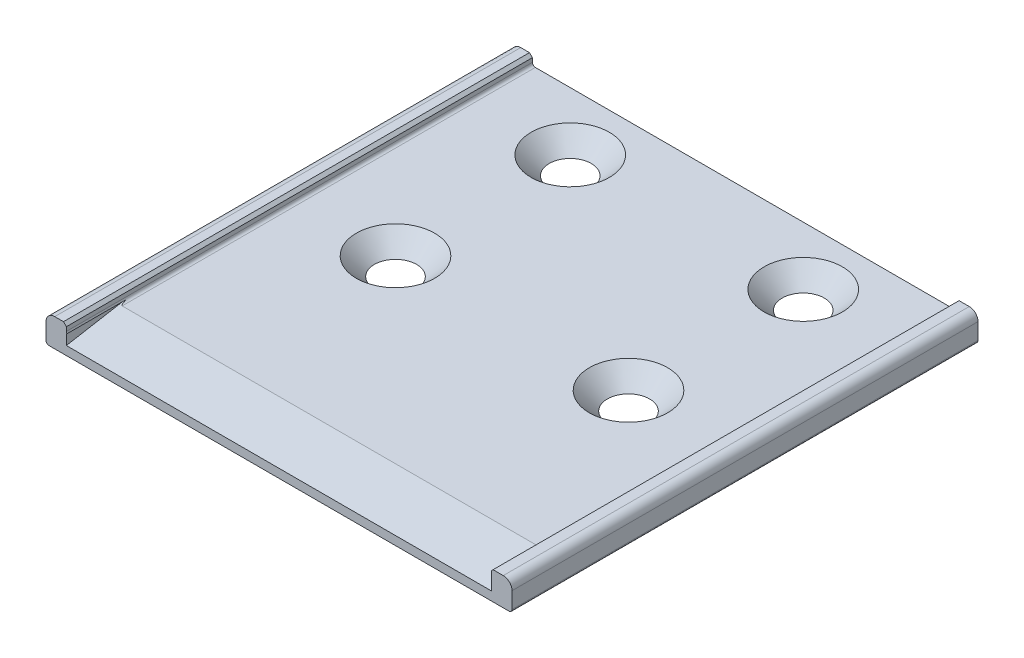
from build123d import *

# Parameters (mm, degrees)
BOSS_EXTRUDE1_DEPTH                                  = 80
CSK_FOR_M6_HEX_SOCKET_COUNTERSUNK_CAP_SC_D           = 6.6
CSK_FOR_M6_HEX_SOCKET_COUNTERSUNK_CAP_SC_DEPTH       = 38
CSK_FOR_M6_HEX_SOCKET_COUNTERSUNK_CAP_SC_CSINK_D     = 13.44
CSK_FOR_M6_HEX_SOCKET_COUNTERSUNK_CAP_SC_CSINK_ANGLE = 90
CSK_FOR_M6_HEX_SOCKET_COUNTERSUNK_CAP_SC_TIP         = 1.982840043
CUT_EXTRUDE1_DEPTH                                   = 36.5


with BuildPart() as part:
    # Sketch1 → Boss-Extrude1 (new body)
    with BuildSketch(Plane.XY):
        with BuildLine():
            Line((76.75, 4.8), (78.5, 4.8))
            ThreePointArc((78.5, 4.8), (79.560660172, 4.360660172), (80, 3.3))
            Line((80, 3.3), (80, 0.5))
            ThreePointArc((80, 0.5), (79.853553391, 0.146446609), (79.5, 0))
            Line((79.5, 0), (0.5, 0))
            ThreePointArc((0.5, 0), (0.146446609, 0.146446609), (0, 0.5))
            Line((0, 0.5), (0, 3.3))
            ThreePointArc((0, 3.3), (0.439339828, 4.360660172), (1.5, 4.8))
            Line((1.5, 4.8), (3, 4.8))
            Line((3, 4.8), (3.5, 4.3))
            Line((3.5, 4.3), (3.5, 3.6))
            ThreePointArc((3.5, 3.6), (3.646446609, 3.246446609), (4, 3.1))
            Line((4, 3.1), (76, 3.1))
            ThreePointArc((76, 3.1), (76.353553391, 3.246446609), (76.5, 3.6))
            Line((76.5, 3.6), (76.5, 4.55))
            Line((76.5, 4.55), (76.75, 4.8))
        make_face()
    extrude(amount=-BOSS_EXTRUDE1_DEPTH)

    # CSK for M6 Hex Socket Countersunk Cap Sc
    with Locations(Plane(origin=(0, 3.1, 0), x_dir=(1, 0, 0), z_dir=(0, 1, 0))):
        with Locations((20, 40), (20, 70), (60, 40), (60, 70)):
            CounterSinkHole(CSK_FOR_M6_HEX_SOCKET_COUNTERSUNK_CAP_SC_D / 2, CSK_FOR_M6_HEX_SOCKET_COUNTERSUNK_CAP_SC_CSINK_D / 2, depth=CSK_FOR_M6_HEX_SOCKET_COUNTERSUNK_CAP_SC_DEPTH, counter_sink_angle=CSK_FOR_M6_HEX_SOCKET_COUNTERSUNK_CAP_SC_CSINK_ANGLE)
            with Locations((0, 0, -(CSK_FOR_M6_HEX_SOCKET_COUNTERSUNK_CAP_SC_DEPTH + CSK_FOR_M6_HEX_SOCKET_COUNTERSUNK_CAP_SC_TIP / 2))):  # 118° drill point
                Cone(0, CSK_FOR_M6_HEX_SOCKET_COUNTERSUNK_CAP_SC_D / 2, CSK_FOR_M6_HEX_SOCKET_COUNTERSUNK_CAP_SC_TIP, mode=Mode.SUBTRACT)

    # Sketch5 → Cut-Extrude1 (cut, symmetric)
    with BuildSketch(Plane(origin=(40, 0, 0), x_dir=(0, 0, -1), z_dir=(1, 0, 0))):
        Polygon((0, 1.5), (10.208307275, 3.3), (-0.796147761, 3.3), (-0.796147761, 1.5), align=None)
    extrude(amount=CUT_EXTRUDE1_DEPTH, both=True, mode=Mode.SUBTRACT)


solid = part.part
